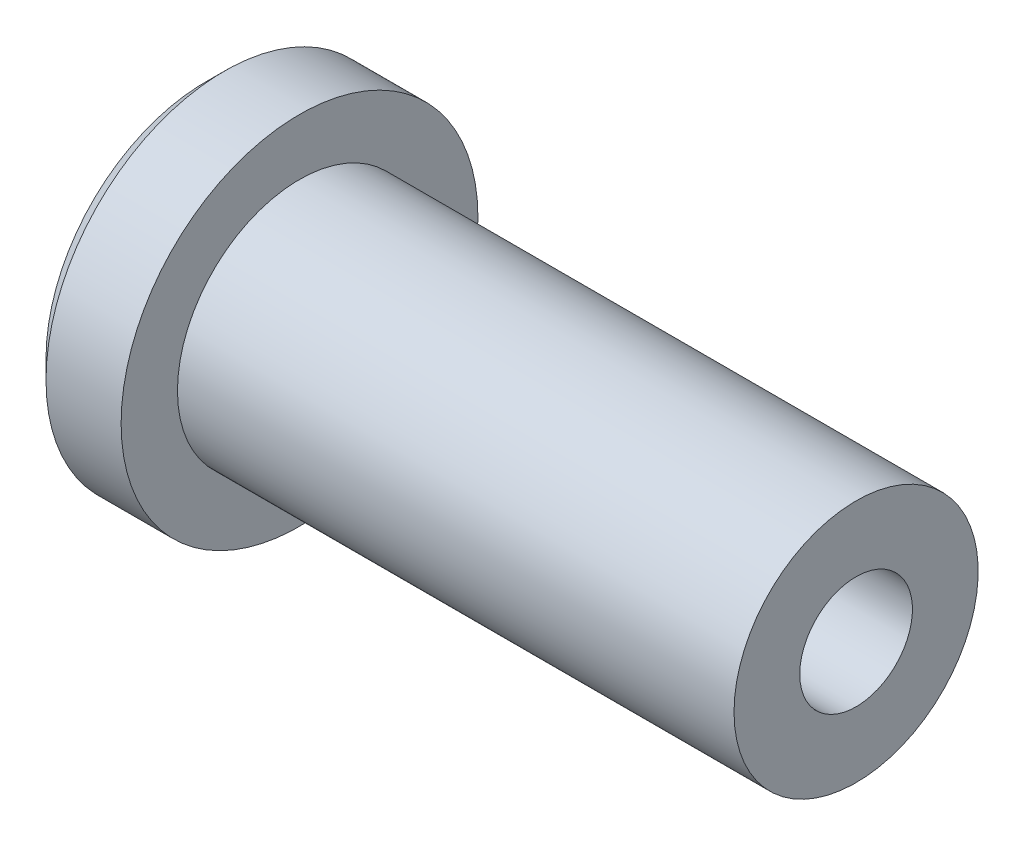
from build123d import *

# Parameters (mm, degrees)
ESQUISSE2_R             = 9
ENL_V_MAT_EXTRU_1_DEPTH = 14
ESQUISSE3_R             = 6
ENL_V_MAT_EXTRU_2_DEPTH = 62.457253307


with BuildPart() as part:
    # Esquisse1 → Base-R_volution (revolve)
    with BuildSketch(Plane.XY, mode=Mode.PRIVATE) as base_r_volution_sk:
        Polygon((0, 0), (0, 17), (2, 19), (10, 19), (10, 13), (69.272, 13), (69.272, 0), align=None)
    revolve(base_r_volution_sk.sketch.rotate(Axis((-10, 0, 0), (1, 0, 0)), 90), axis=Axis((-10, 0, 0), (1, 0, 0)))

    # Esquisse2 → Enl_v. mat.-Extru.1 (cut)
    with BuildSketch(Plane.ZY):
        Circle(ESQUISSE2_R)
    extrude(amount=-ENL_V_MAT_EXTRU_1_DEPTH, mode=Mode.SUBTRACT)

    # Esquisse3 → Enl_v. mat.-Extru.2 (cut, through all)
    with BuildSketch(Plane.ZY.offset(-14)):
        Circle(ESQUISSE3_R)
    extrude(amount=-ENL_V_MAT_EXTRU_2_DEPTH, mode=Mode.SUBTRACT)


solid = part.part
